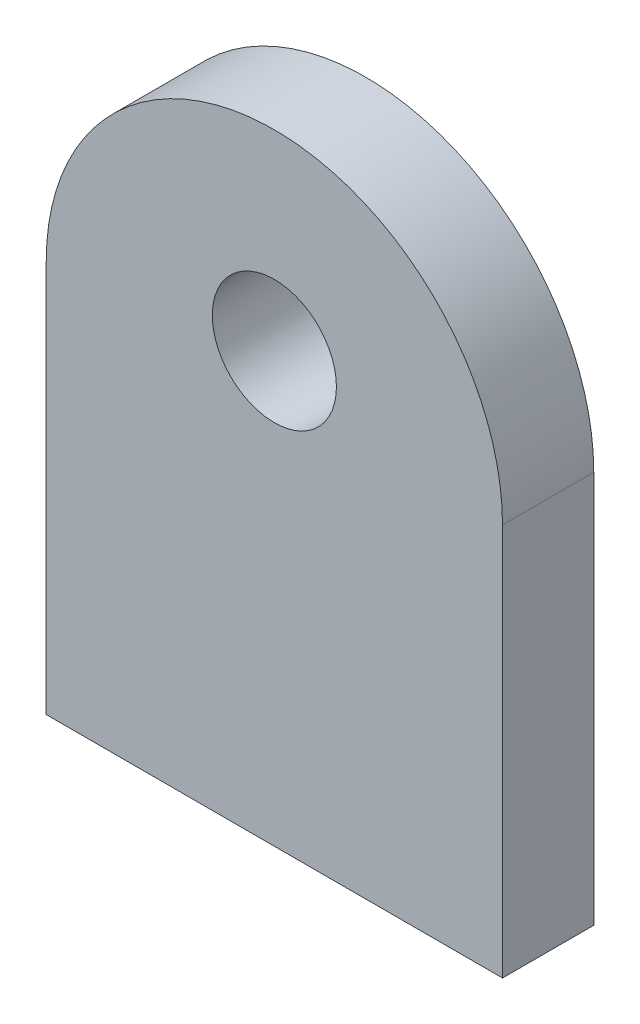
from build123d import *

# Parameters (mm, degrees)
BOSS_EXTRU_1_DEPTH = 5
TROU_TARAUD_M81_D  = 6.8


with BuildPart() as part:
    # Esquisse1 → Boss.-Extru.1 (new body)
    with BuildSketch(Plane.XY):
        with BuildLine():
            Line((-12.5, 0), (12.5, 0))
            Line((12.5, 0), (12.5, 21.5))
            ThreePointArc((12.5, 21.5), (0, 34), (-12.5, 21.5))
            Line((-12.5, 21.5), (-12.5, 0))
        make_face()
    extrude(amount=BOSS_EXTRU_1_DEPTH)

    # Trou taraud_ M81 (through all)
    with Locations(Plane.XY.offset(5)):
        with Locations((0, 23.5)):
            Hole(TROU_TARAUD_M81_D / 2)


solid = part.part
